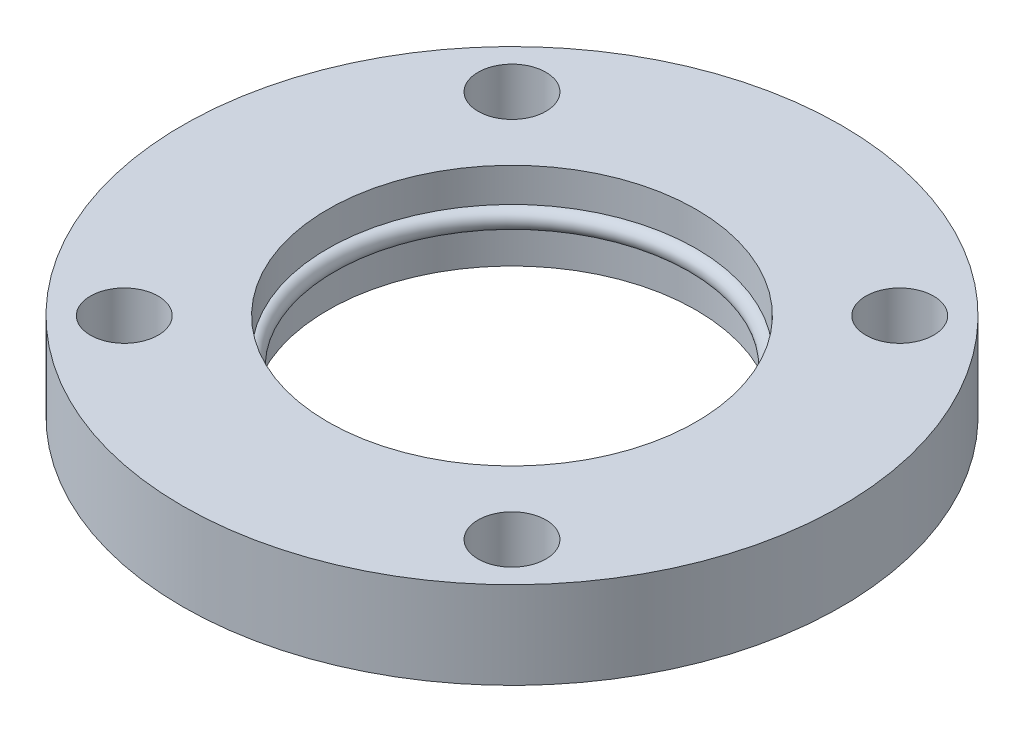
ISO-10303-21;
HEADER;
FILE_DESCRIPTION(('STEP AP214'),'2;1');
FILE_NAME('part.step','',(''),(''),'','','');
FILE_SCHEMA(('AUTOMOTIVE_DESIGN { 1 0 10303 214 1 1 1 1 }'));
ENDSEC;
DATA;
#1=APPLICATION_CONTEXT('core data for automotive mechanical design processes');
#2=APPLICATION_PROTOCOL_DEFINITION('international standard','automotive_design',2000,#1);
#3=PRODUCT_CONTEXT('',#1,'mechanical');
#4=PRODUCT('Part','Part','',(#3));
#5=PRODUCT_RELATED_PRODUCT_CATEGORY('part','',(#4));
#6=PRODUCT_DEFINITION_FORMATION('','',#4);
#7=PRODUCT_DEFINITION_CONTEXT('part definition',#1,'design');
#8=PRODUCT_DEFINITION('design','',#6,#7);
#9=PRODUCT_DEFINITION_SHAPE('','',#8);
#10=(LENGTH_UNIT() NAMED_UNIT(*) SI_UNIT(.MILLI.,.METRE.));
#11=(NAMED_UNIT(*) PLANE_ANGLE_UNIT() SI_UNIT($,.RADIAN.));
#12=(NAMED_UNIT(*) SI_UNIT($,.STERADIAN.) SOLID_ANGLE_UNIT());
#13=UNCERTAINTY_MEASURE_WITH_UNIT(LENGTH_MEASURE(1.E-05),#10,'distance_accuracy_value','');
#14=(GEOMETRIC_REPRESENTATION_CONTEXT(3) GLOBAL_UNCERTAINTY_ASSIGNED_CONTEXT((#13)) GLOBAL_UNIT_ASSIGNED_CONTEXT((#10,
#11,#12)) REPRESENTATION_CONTEXT('',''));
#15=CARTESIAN_POINT('',(0.,0.,0.));
#16=DIRECTION('',(0.,0.,1.));
#17=DIRECTION('',(1.,0.,0.));
#18=AXIS2_PLACEMENT_3D('',#15,#16,#17);
#19=CARTESIAN_POINT('',(0.,4.5,0.));
#20=DIRECTION('',(0.,-1.,0.));
#21=DIRECTION('',(0.,0.,-1.));
#22=AXIS2_PLACEMENT_3D('',#19,#20,#21);
#23=CYLINDRICAL_SURFACE('',#22,19.);
#24=CARTESIAN_POINT('',(0.,-4.5,0.));
#25=DIRECTION('',(0.,1.,0.));
#26=DIRECTION('',(0.,0.,1.));
#27=AXIS2_PLACEMENT_3D('',#24,#25,#26);
#28=CIRCLE('',#27,19.);
#29=CARTESIAN_POINT('',(0.,-4.5,19.));
#30=VERTEX_POINT('',#29);
#31=EDGE_CURVE('E52',#30,#30,#28,.T.);
#32=ORIENTED_EDGE('',*,*,#31,.F.);
#33=EDGE_LOOP('',(#32));
#34=FACE_BOUND('',#33,.T.);
#35=CARTESIAN_POINT('',(0.,-1.,0.));
#36=DIRECTION('',(0.,1.,0.));
#37=DIRECTION('',(0.,0.,1.));
#38=AXIS2_PLACEMENT_3D('',#35,#36,#37);
#39=CIRCLE('',#38,19.);
#40=CARTESIAN_POINT('',(0.,-1.,19.));
#41=VERTEX_POINT('',#40);
#42=EDGE_CURVE('E40',#41,#41,#39,.T.);
#43=ORIENTED_EDGE('',*,*,#42,.T.);
#44=EDGE_LOOP('',(#43));
#45=FACE_BOUND('',#44,.T.);
#46=ADVANCED_FACE('F36',(#34,#45),#23,.F.);
#47=CARTESIAN_POINT('',(0.,4.5,0.));
#48=DIRECTION('',(0.,1.,0.));
#49=DIRECTION('',(0.,0.,1.));
#50=AXIS2_PLACEMENT_3D('',#47,#48,#49);
#51=CIRCLE('',#50,19.);
#52=CARTESIAN_POINT('',(0.,4.5,19.));
#53=VERTEX_POINT('',#52);
#54=EDGE_CURVE('E49',#53,#53,#51,.T.);
#55=ORIENTED_EDGE('',*,*,#54,.T.);
#56=EDGE_LOOP('',(#55));
#57=FACE_BOUND('',#56,.T.);
#58=CARTESIAN_POINT('',(0.,1.,0.));
#59=DIRECTION('',(0.,-1.,0.));
#60=DIRECTION('',(0.,0.,-1.));
#61=AXIS2_PLACEMENT_3D('',#58,#59,#60);
#62=CIRCLE('',#61,19.);
#63=CARTESIAN_POINT('',(0.,1.,-19.));
#64=VERTEX_POINT('',#63);
#65=EDGE_CURVE('E54',#64,#64,#62,.T.);
#66=ORIENTED_EDGE('',*,*,#65,.T.);
#67=EDGE_LOOP('',(#66));
#68=FACE_BOUND('',#67,.T.);
#69=ADVANCED_FACE('F97',(#57,#68),#23,.F.);
#70=CARTESIAN_POINT('',(0.,4.5,0.));
#71=DIRECTION('',(0.,1.,0.));
#72=DIRECTION('',(0.,0.,1.));
#73=AXIS2_PLACEMENT_3D('',#70,#71,#72);
#74=PLANE('',#73);
#75=CARTESIAN_POINT('',(20.,4.5,20.));
#76=DIRECTION('',(0.,1.,0.));
#77=DIRECTION('',(0.,0.,1.));
#78=AXIS2_PLACEMENT_3D('',#75,#76,#77);
#79=CIRCLE('',#78,3.5);
#80=CARTESIAN_POINT('',(20.,4.5,23.5));
#81=VERTEX_POINT('',#80);
#82=EDGE_CURVE('E71',#81,#81,#79,.T.);
#83=ORIENTED_EDGE('',*,*,#82,.F.);
#84=EDGE_LOOP('',(#83));
#85=FACE_BOUND('',#84,.T.);
#86=CARTESIAN_POINT('',(-20.,4.5,-20.));
#87=DIRECTION('',(0.,1.,0.));
#88=DIRECTION('',(0.,0.,1.));
#89=AXIS2_PLACEMENT_3D('',#86,#87,#88);
#90=CIRCLE('',#89,3.5);
#91=CARTESIAN_POINT('',(-20.,4.5,-16.5));
#92=VERTEX_POINT('',#91);
#93=EDGE_CURVE('E83',#92,#92,#90,.T.);
#94=ORIENTED_EDGE('',*,*,#93,.F.);
#95=EDGE_LOOP('',(#94));
#96=FACE_BOUND('',#95,.T.);
#97=CARTESIAN_POINT('',(0.,4.5,0.));
#98=DIRECTION('',(0.,1.,0.));
#99=DIRECTION('',(0.,0.,1.));
#100=AXIS2_PLACEMENT_3D('',#97,#98,#99);
#101=CIRCLE('',#100,34.);
#102=CARTESIAN_POINT('',(0.,4.5,34.));
#103=VERTEX_POINT('',#102);
#104=EDGE_CURVE('E10',#103,#103,#101,.T.);
#105=ORIENTED_EDGE('',*,*,#104,.T.);
#106=EDGE_LOOP('',(#105));
#107=FACE_BOUND('',#106,.T.);
#108=ORIENTED_EDGE('',*,*,#54,.F.);
#109=EDGE_LOOP('',(#108));
#110=FACE_BOUND('',#109,.T.);
#111=CARTESIAN_POINT('',(20.,4.5,-20.));
#112=DIRECTION('',(0.,1.,0.));
#113=DIRECTION('',(0.,0.,1.));
#114=AXIS2_PLACEMENT_3D('',#111,#112,#113);
#115=CIRCLE('',#114,3.5);
#116=CARTESIAN_POINT('',(20.,4.5,-16.5));
#117=VERTEX_POINT('',#116);
#118=EDGE_CURVE('E77',#117,#117,#115,.T.);
#119=ORIENTED_EDGE('',*,*,#118,.F.);
#120=EDGE_LOOP('',(#119));
#121=FACE_BOUND('',#120,.T.);
#122=CARTESIAN_POINT('',(-20.,4.5,20.));
#123=DIRECTION('',(0.,1.,0.));
#124=DIRECTION('',(0.,0.,1.));
#125=AXIS2_PLACEMENT_3D('',#122,#123,#124);
#126=CIRCLE('',#125,3.5);
#127=CARTESIAN_POINT('',(-20.,4.5,23.5));
#128=VERTEX_POINT('',#127);
#129=EDGE_CURVE('E63',#128,#128,#126,.T.);
#130=ORIENTED_EDGE('',*,*,#129,.F.);
#131=EDGE_LOOP('',(#130));
#132=FACE_BOUND('',#131,.T.);
#133=ADVANCED_FACE('F102',(#85,#96,#107,#110,#121,#132),#74,.T.);
#134=CARTESIAN_POINT('',(0.,-4.5,0.));
#135=DIRECTION('',(0.,1.,0.));
#136=DIRECTION('',(0.,0.,1.));
#137=AXIS2_PLACEMENT_3D('',#134,#135,#136);
#138=PLANE('',#137);
#139=CARTESIAN_POINT('',(0.,-4.5,0.));
#140=DIRECTION('',(0.,1.,0.));
#141=DIRECTION('',(0.,0.,1.));
#142=AXIS2_PLACEMENT_3D('',#139,#140,#141);
#143=CIRCLE('',#142,34.);
#144=CARTESIAN_POINT('',(0.,-4.5,34.));
#145=VERTEX_POINT('',#144);
#146=EDGE_CURVE('E44',#145,#145,#143,.T.);
#147=ORIENTED_EDGE('',*,*,#146,.F.);
#148=EDGE_LOOP('',(#147));
#149=FACE_BOUND('',#148,.T.);
#150=ORIENTED_EDGE('',*,*,#31,.T.);
#151=EDGE_LOOP('',(#150));
#152=FACE_BOUND('',#151,.T.);
#153=CARTESIAN_POINT('',(-20.,-4.5,-20.));
#154=DIRECTION('',(0.,1.,0.));
#155=DIRECTION('',(0.,0.,1.));
#156=AXIS2_PLACEMENT_3D('',#153,#154,#155);
#157=CIRCLE('',#156,3.5);
#158=CARTESIAN_POINT('',(-20.,-4.5,-16.5));
#159=VERTEX_POINT('',#158);
#160=EDGE_CURVE('E80',#159,#159,#157,.T.);
#161=ORIENTED_EDGE('',*,*,#160,.T.);
#162=EDGE_LOOP('',(#161));
#163=FACE_BOUND('',#162,.T.);
#164=CARTESIAN_POINT('',(20.,-4.5,-20.));
#165=DIRECTION('',(0.,1.,0.));
#166=DIRECTION('',(0.,0.,1.));
#167=AXIS2_PLACEMENT_3D('',#164,#165,#166);
#168=CIRCLE('',#167,3.5);
#169=CARTESIAN_POINT('',(20.,-4.5,-16.5));
#170=VERTEX_POINT('',#169);
#171=EDGE_CURVE('E74',#170,#170,#168,.T.);
#172=ORIENTED_EDGE('',*,*,#171,.T.);
#173=EDGE_LOOP('',(#172));
#174=FACE_BOUND('',#173,.T.);
#175=CARTESIAN_POINT('',(20.,-4.5,20.));
#176=DIRECTION('',(0.,1.,0.));
#177=DIRECTION('',(0.,0.,1.));
#178=AXIS2_PLACEMENT_3D('',#175,#176,#177);
#179=CIRCLE('',#178,3.5);
#180=CARTESIAN_POINT('',(20.,-4.5,23.5));
#181=VERTEX_POINT('',#180);
#182=EDGE_CURVE('E68',#181,#181,#179,.T.);
#183=ORIENTED_EDGE('',*,*,#182,.T.);
#184=EDGE_LOOP('',(#183));
#185=FACE_BOUND('',#184,.T.);
#186=CARTESIAN_POINT('',(-20.,-4.5,20.));
#187=DIRECTION('',(0.,1.,0.));
#188=DIRECTION('',(0.,0.,1.));
#189=AXIS2_PLACEMENT_3D('',#186,#187,#188);
#190=CIRCLE('',#189,3.5);
#191=CARTESIAN_POINT('',(-20.,-4.5,23.5));
#192=VERTEX_POINT('',#191);
#193=EDGE_CURVE('E59',#192,#192,#190,.T.);
#194=ORIENTED_EDGE('',*,*,#193,.T.);
#195=EDGE_LOOP('',(#194));
#196=FACE_BOUND('',#195,.T.);
#197=ADVANCED_FACE('F93',(#149,#152,#163,#174,#185,#196),#138,.F.);
#198=CARTESIAN_POINT('',(0.,4.5,0.));
#199=DIRECTION('',(0.,-1.,0.));
#200=DIRECTION('',(0.,0.,-1.));
#201=AXIS2_PLACEMENT_3D('',#198,#199,#200);
#202=CYLINDRICAL_SURFACE('',#201,34.);
#203=ORIENTED_EDGE('',*,*,#104,.F.);
#204=EDGE_LOOP('',(#203));
#205=FACE_BOUND('',#204,.T.);
#206=ORIENTED_EDGE('',*,*,#146,.T.);
#207=EDGE_LOOP('',(#206));
#208=FACE_BOUND('',#207,.T.);
#209=ADVANCED_FACE('F38',(#205,#208),#202,.T.);
#210=CARTESIAN_POINT('',(-20.,4.5,-20.));
#211=DIRECTION('',(0.,-1.,0.));
#212=DIRECTION('',(0.,0.,-1.));
#213=AXIS2_PLACEMENT_3D('',#210,#211,#212);
#214=CYLINDRICAL_SURFACE('',#213,3.5);
#215=ORIENTED_EDGE('',*,*,#93,.T.);
#216=EDGE_LOOP('',(#215));
#217=FACE_BOUND('',#216,.T.);
#218=ORIENTED_EDGE('',*,*,#160,.F.);
#219=EDGE_LOOP('',(#218));
#220=FACE_BOUND('',#219,.T.);
#221=ADVANCED_FACE('F105',(#217,#220),#214,.F.);
#222=CARTESIAN_POINT('',(20.,4.5,-20.));
#223=DIRECTION('',(0.,-1.,0.));
#224=DIRECTION('',(0.,0.,-1.));
#225=AXIS2_PLACEMENT_3D('',#222,#223,#224);
#226=CYLINDRICAL_SURFACE('',#225,3.5);
#227=ORIENTED_EDGE('',*,*,#118,.T.);
#228=EDGE_LOOP('',(#227));
#229=FACE_BOUND('',#228,.T.);
#230=ORIENTED_EDGE('',*,*,#171,.F.);
#231=EDGE_LOOP('',(#230));
#232=FACE_BOUND('',#231,.T.);
#233=ADVANCED_FACE('F120',(#229,#232),#226,.F.);
#234=CARTESIAN_POINT('',(20.,4.5,20.));
#235=DIRECTION('',(0.,-1.,0.));
#236=DIRECTION('',(0.,0.,-1.));
#237=AXIS2_PLACEMENT_3D('',#234,#235,#236);
#238=CYLINDRICAL_SURFACE('',#237,3.5);
#239=ORIENTED_EDGE('',*,*,#82,.T.);
#240=EDGE_LOOP('',(#239));
#241=FACE_BOUND('',#240,.T.);
#242=ORIENTED_EDGE('',*,*,#182,.F.);
#243=EDGE_LOOP('',(#242));
#244=FACE_BOUND('',#243,.T.);
#245=ADVANCED_FACE('F125',(#241,#244),#238,.F.);
#246=CARTESIAN_POINT('',(-20.,4.5,20.));
#247=DIRECTION('',(0.,-1.,0.));
#248=DIRECTION('',(0.,0.,-1.));
#249=AXIS2_PLACEMENT_3D('',#246,#247,#248);
#250=CYLINDRICAL_SURFACE('',#249,3.5);
#251=ORIENTED_EDGE('',*,*,#129,.T.);
#252=EDGE_LOOP('',(#251));
#253=FACE_BOUND('',#252,.T.);
#254=ORIENTED_EDGE('',*,*,#193,.F.);
#255=EDGE_LOOP('',(#254));
#256=FACE_BOUND('',#255,.T.);
#257=ADVANCED_FACE('F136',(#253,#256),#250,.F.);
#258=CARTESIAN_POINT('',(0.,0.,0.));
#259=DIRECTION('',(0.,-1.,0.));
#260=DIRECTION('',(0.,0.,-1.));
#261=AXIS2_PLACEMENT_3D('',#258,#259,#260);
#262=TOROIDAL_SURFACE('',#261,19.,1.);
#263=ORIENTED_EDGE('',*,*,#65,.F.);
#264=EDGE_LOOP('',(#263));
#265=FACE_BOUND('',#264,.T.);
#266=ORIENTED_EDGE('',*,*,#42,.F.);
#267=EDGE_LOOP('',(#266));
#268=FACE_BOUND('',#267,.T.);
#269=ADVANCED_FACE('F142',(#265,#268),#262,.T.);
#270=CLOSED_SHELL('',(#46,#69,#133,#197,#209,#221,#233,#245,#257,#269));
#271=MANIFOLD_SOLID_BREP('B2',#270);
#272=ADVANCED_BREP_SHAPE_REPRESENTATION('',(#18,#271),#14);
#273=SHAPE_DEFINITION_REPRESENTATION(#9,#272);
ENDSEC;
END-ISO-10303-21;
